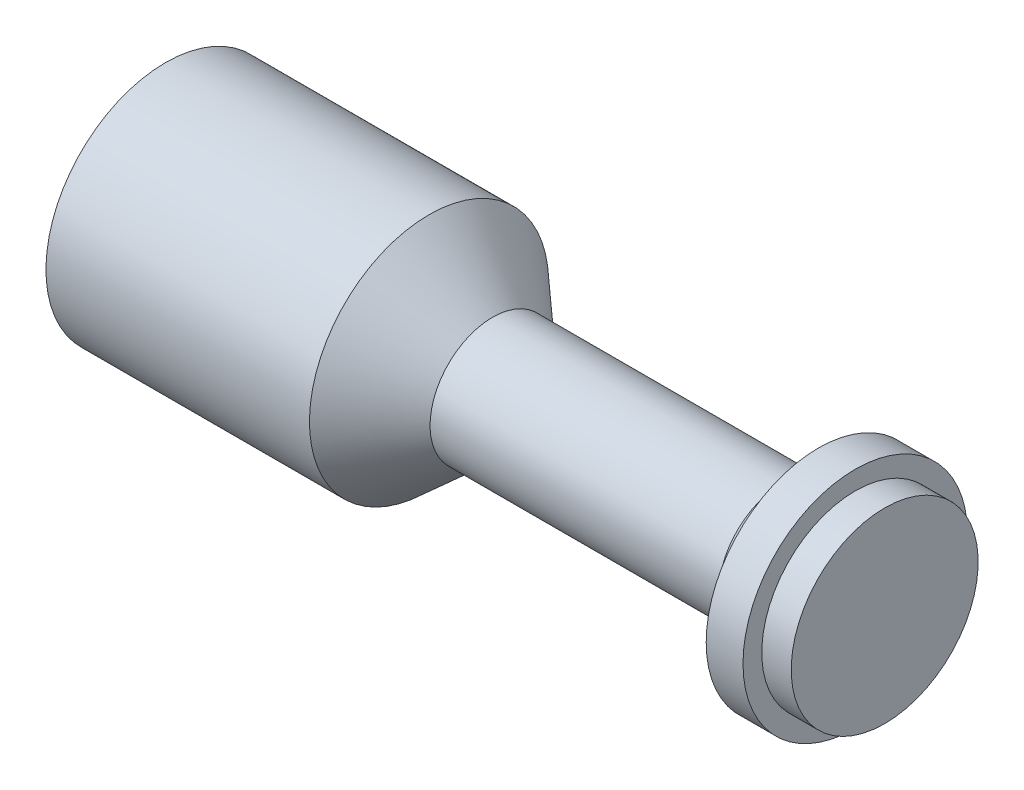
ISO-10303-21;
HEADER;
FILE_DESCRIPTION(('STEP AP214'),'2;1');
FILE_NAME('part.step','',(''),(''),'','','');
FILE_SCHEMA(('AUTOMOTIVE_DESIGN { 1 0 10303 214 1 1 1 1 }'));
ENDSEC;
DATA;
#1=APPLICATION_CONTEXT('core data for automotive mechanical design processes');
#2=APPLICATION_PROTOCOL_DEFINITION('international standard','automotive_design',2000,#1);
#3=PRODUCT_CONTEXT('',#1,'mechanical');
#4=PRODUCT('Part','Part','',(#3));
#5=PRODUCT_RELATED_PRODUCT_CATEGORY('part','',(#4));
#6=PRODUCT_DEFINITION_FORMATION('','',#4);
#7=PRODUCT_DEFINITION_CONTEXT('part definition',#1,'design');
#8=PRODUCT_DEFINITION('design','',#6,#7);
#9=PRODUCT_DEFINITION_SHAPE('','',#8);
#10=(LENGTH_UNIT() NAMED_UNIT(*) SI_UNIT(.MILLI.,.METRE.));
#11=(NAMED_UNIT(*) PLANE_ANGLE_UNIT() SI_UNIT($,.RADIAN.));
#12=(NAMED_UNIT(*) SI_UNIT($,.STERADIAN.) SOLID_ANGLE_UNIT());
#13=UNCERTAINTY_MEASURE_WITH_UNIT(LENGTH_MEASURE(1.E-05),#10,'distance_accuracy_value','');
#14=(GEOMETRIC_REPRESENTATION_CONTEXT(3) GLOBAL_UNCERTAINTY_ASSIGNED_CONTEXT((#13)) GLOBAL_UNIT_ASSIGNED_CONTEXT((#10,
#11,#12)) REPRESENTATION_CONTEXT('',''));
#15=CARTESIAN_POINT('',(0.,0.,0.));
#16=DIRECTION('',(0.,0.,1.));
#17=DIRECTION('',(1.,0.,0.));
#18=AXIS2_PLACEMENT_3D('',#15,#16,#17);
#19=CARTESIAN_POINT('',(-60.0156555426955,0.,0.));
#20=DIRECTION('',(-1.,0.,0.));
#21=DIRECTION('',(0.,-1.,0.));
#22=AXIS2_PLACEMENT_3D('',#19,#20,#21);
#23=PLANE('',#22);
#24=CARTESIAN_POINT('',(-60.0156555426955,0.,0.));
#25=DIRECTION('',(1.,0.,0.));
#26=DIRECTION('',(0.,1.,0.));
#27=AXIS2_PLACEMENT_3D('',#24,#25,#26);
#28=CIRCLE('',#27,16.25);
#29=CARTESIAN_POINT('',(-60.0156555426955,16.25,0.));
#30=VERTEX_POINT('',#29);
#31=EDGE_CURVE('E10',#30,#30,#28,.T.);
#32=ORIENTED_EDGE('',*,*,#31,.F.);
#33=EDGE_LOOP('',(#32));
#34=FACE_BOUND('',#33,.T.);
#35=ADVANCED_FACE('F30',(#34),#23,.T.);
#36=CARTESIAN_POINT('',(37.6843444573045,0.,0.));
#37=DIRECTION('',(1.,0.,0.));
#38=DIRECTION('',(0.,1.,0.));
#39=AXIS2_PLACEMENT_3D('',#36,#37,#38);
#40=CYLINDRICAL_SURFACE('',#39,16.25);
#41=ORIENTED_EDGE('',*,*,#31,.T.);
#42=EDGE_LOOP('',(#41));
#43=FACE_BOUND('',#42,.T.);
#44=CARTESIAN_POINT('',(-24.2156555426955,0.,0.));
#45=DIRECTION('',(1.,0.,0.));
#46=DIRECTION('',(0.,1.,0.));
#47=AXIS2_PLACEMENT_3D('',#44,#45,#46);
#48=CIRCLE('',#47,16.25);
#49=CARTESIAN_POINT('',(-24.2156555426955,16.25,0.));
#50=VERTEX_POINT('',#49);
#51=EDGE_CURVE('E36',#50,#50,#48,.T.);
#52=ORIENTED_EDGE('',*,*,#51,.F.);
#53=EDGE_LOOP('',(#52));
#54=FACE_BOUND('',#53,.T.);
#55=ADVANCED_FACE('F84',(#43,#54),#40,.T.);
#56=CARTESIAN_POINT('',(-15.5828430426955,0.,0.));
#57=DIRECTION('',(-1.,0.,0.));
#58=DIRECTION('',(0.,-1.,0.));
#59=AXIS2_PLACEMENT_3D('',#56,#57,#58);
#60=CONICAL_SURFACE('',#59,8.5,0.731563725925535);
#61=ORIENTED_EDGE('',*,*,#51,.T.);
#62=EDGE_LOOP('',(#61));
#63=FACE_BOUND('',#62,.T.);
#64=CARTESIAN_POINT('',(-15.5828430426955,0.,0.));
#65=DIRECTION('',(1.,0.,0.));
#66=DIRECTION('',(0.,1.,0.));
#67=AXIS2_PLACEMENT_3D('',#64,#65,#66);
#68=CIRCLE('',#67,8.5);
#69=CARTESIAN_POINT('',(-15.5828430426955,8.50000000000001,0.));
#70=VERTEX_POINT('',#69);
#71=EDGE_CURVE('E40',#70,#70,#68,.T.);
#72=ORIENTED_EDGE('',*,*,#71,.F.);
#73=EDGE_LOOP('',(#72));
#74=FACE_BOUND('',#73,.T.);
#75=ADVANCED_FACE('F89',(#63,#74),#60,.T.);
#76=CARTESIAN_POINT('',(37.6843444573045,0.,0.));
#77=DIRECTION('',(1.,0.,0.));
#78=DIRECTION('',(0.,1.,0.));
#79=AXIS2_PLACEMENT_3D('',#76,#77,#78);
#80=CYLINDRICAL_SURFACE('',#79,8.5);
#81=ORIENTED_EDGE('',*,*,#71,.T.);
#82=EDGE_LOOP('',(#81));
#83=FACE_BOUND('',#82,.T.);
#84=CARTESIAN_POINT('',(23.6491428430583,0.,0.));
#85=DIRECTION('',(1.,0.,0.));
#86=DIRECTION('',(0.,1.,0.));
#87=AXIS2_PLACEMENT_3D('',#84,#85,#86);
#88=CIRCLE('',#87,8.49999999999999);
#89=CARTESIAN_POINT('',(23.6491428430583,8.50000000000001,0.));
#90=VERTEX_POINT('',#89);
#91=EDGE_CURVE('E44',#90,#90,#88,.T.);
#92=ORIENTED_EDGE('',*,*,#91,.F.);
#93=EDGE_LOOP('',(#92));
#94=FACE_BOUND('',#93,.T.);
#95=ADVANCED_FACE('F93',(#83,#94),#80,.T.);
#96=CARTESIAN_POINT('',(26.0596852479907,0.,0.));
#97=DIRECTION('',(1.,0.,0.));
#98=DIRECTION('',(0.,1.,0.));
#99=AXIS2_PLACEMENT_3D('',#96,#97,#98);
#100=CONICAL_SURFACE('',#99,10.9105424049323,0.785398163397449);
#101=ORIENTED_EDGE('',*,*,#91,.T.);
#102=EDGE_LOOP('',(#101));
#103=FACE_BOUND('',#102,.T.);
#104=CARTESIAN_POINT('',(26.0596852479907,0.,0.));
#105=DIRECTION('',(1.,0.,0.));
#106=DIRECTION('',(0.,1.,0.));
#107=AXIS2_PLACEMENT_3D('',#104,#105,#106);
#108=CIRCLE('',#107,10.9105424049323);
#109=CARTESIAN_POINT('',(26.0596852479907,10.9105424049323,0.));
#110=VERTEX_POINT('',#109);
#111=EDGE_CURVE('E49',#110,#110,#108,.T.);
#112=ORIENTED_EDGE('',*,*,#111,.F.);
#113=EDGE_LOOP('',(#112));
#114=FACE_BOUND('',#113,.T.);
#115=ADVANCED_FACE('F99',(#103,#114),#100,.T.);
#116=CARTESIAN_POINT('',(37.6843444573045,0.,0.));
#117=DIRECTION('',(1.,0.,0.));
#118=DIRECTION('',(0.,1.,0.));
#119=AXIS2_PLACEMENT_3D('',#116,#117,#118);
#120=CYLINDRICAL_SURFACE('',#119,10.9105424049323);
#121=ORIENTED_EDGE('',*,*,#111,.T.);
#122=EDGE_LOOP('',(#121));
#123=FACE_BOUND('',#122,.T.);
#124=CARTESIAN_POINT('',(28.6843444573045,0.,0.));
#125=DIRECTION('',(1.,0.,0.));
#126=DIRECTION('',(0.,1.,0.));
#127=AXIS2_PLACEMENT_3D('',#124,#125,#126);
#128=CIRCLE('',#127,10.9105424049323);
#129=CARTESIAN_POINT('',(28.6843444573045,10.9105424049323,0.));
#130=VERTEX_POINT('',#129);
#131=EDGE_CURVE('E52',#130,#130,#128,.T.);
#132=ORIENTED_EDGE('',*,*,#131,.F.);
#133=EDGE_LOOP('',(#132));
#134=FACE_BOUND('',#133,.T.);
#135=ADVANCED_FACE('F103',(#123,#134),#120,.T.);
#136=CARTESIAN_POINT('',(28.6843444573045,10.9105424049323,0.));
#137=DIRECTION('',(-1.,0.,0.));
#138=DIRECTION('',(0.,-1.,0.));
#139=AXIS2_PLACEMENT_3D('',#136,#137,#138);
#140=PLANE('',#139);
#141=ORIENTED_EDGE('',*,*,#131,.T.);
#142=EDGE_LOOP('',(#141));
#143=FACE_BOUND('',#142,.T.);
#144=CARTESIAN_POINT('',(28.6843444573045,0.,0.));
#145=DIRECTION('',(1.,0.,0.));
#146=DIRECTION('',(0.,1.,0.));
#147=AXIS2_PLACEMENT_3D('',#144,#145,#146);
#148=CIRCLE('',#147,15.25);
#149=CARTESIAN_POINT('',(28.6843444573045,15.25,0.));
#150=VERTEX_POINT('',#149);
#151=EDGE_CURVE('E55',#150,#150,#148,.T.);
#152=ORIENTED_EDGE('',*,*,#151,.F.);
#153=EDGE_LOOP('',(#152));
#154=FACE_BOUND('',#153,.T.);
#155=ADVANCED_FACE('F107',(#143,#154),#140,.T.);
#156=CARTESIAN_POINT('',(37.6843444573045,0.,0.));
#157=DIRECTION('',(1.,0.,0.));
#158=DIRECTION('',(0.,1.,0.));
#159=AXIS2_PLACEMENT_3D('',#156,#157,#158);
#160=CYLINDRICAL_SURFACE('',#159,15.25);
#161=ORIENTED_EDGE('',*,*,#151,.T.);
#162=EDGE_LOOP('',(#161));
#163=FACE_BOUND('',#162,.T.);
#164=CARTESIAN_POINT('',(33.6843444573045,0.,0.));
#165=DIRECTION('',(1.,0.,0.));
#166=DIRECTION('',(0.,1.,0.));
#167=AXIS2_PLACEMENT_3D('',#164,#165,#166);
#168=CIRCLE('',#167,15.25);
#169=CARTESIAN_POINT('',(33.6843444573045,15.25,0.));
#170=VERTEX_POINT('',#169);
#171=EDGE_CURVE('E58',#170,#170,#168,.T.);
#172=ORIENTED_EDGE('',*,*,#171,.F.);
#173=EDGE_LOOP('',(#172));
#174=FACE_BOUND('',#173,.T.);
#175=ADVANCED_FACE('F80',(#163,#174),#160,.T.);
#176=CARTESIAN_POINT('',(33.6843444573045,15.25,0.));
#177=DIRECTION('',(1.,0.,0.));
#178=DIRECTION('',(0.,1.,0.));
#179=AXIS2_PLACEMENT_3D('',#176,#177,#178);
#180=PLANE('',#179);
#181=ORIENTED_EDGE('',*,*,#171,.T.);
#182=EDGE_LOOP('',(#181));
#183=FACE_BOUND('',#182,.T.);
#184=CARTESIAN_POINT('',(33.6843444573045,0.,0.));
#185=DIRECTION('',(1.,0.,0.));
#186=DIRECTION('',(0.,1.,0.));
#187=AXIS2_PLACEMENT_3D('',#184,#185,#186);
#188=CIRCLE('',#187,12.7);
#189=CARTESIAN_POINT('',(33.6843444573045,12.7,0.));
#190=VERTEX_POINT('',#189);
#191=EDGE_CURVE('E61',#190,#190,#188,.T.);
#192=ORIENTED_EDGE('',*,*,#191,.F.);
#193=EDGE_LOOP('',(#192));
#194=FACE_BOUND('',#193,.T.);
#195=ADVANCED_FACE('F72',(#183,#194),#180,.T.);
#196=CARTESIAN_POINT('',(37.6843444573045,0.,0.));
#197=DIRECTION('',(1.,0.,0.));
#198=DIRECTION('',(0.,1.,0.));
#199=AXIS2_PLACEMENT_3D('',#196,#197,#198);
#200=CYLINDRICAL_SURFACE('',#199,12.7);
#201=ORIENTED_EDGE('',*,*,#191,.T.);
#202=EDGE_LOOP('',(#201));
#203=FACE_BOUND('',#202,.T.);
#204=CARTESIAN_POINT('',(37.6843444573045,0.,0.));
#205=DIRECTION('',(1.,0.,0.));
#206=DIRECTION('',(0.,1.,0.));
#207=AXIS2_PLACEMENT_3D('',#204,#205,#206);
#208=CIRCLE('',#207,12.7);
#209=CARTESIAN_POINT('',(37.6843444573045,12.7,0.));
#210=VERTEX_POINT('',#209);
#211=EDGE_CURVE('E64',#210,#210,#208,.T.);
#212=ORIENTED_EDGE('',*,*,#211,.F.);
#213=EDGE_LOOP('',(#212));
#214=FACE_BOUND('',#213,.T.);
#215=ADVANCED_FACE('F70',(#203,#214),#200,.T.);
#216=CARTESIAN_POINT('',(37.6843444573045,12.7,0.));
#217=DIRECTION('',(1.,0.,0.));
#218=DIRECTION('',(0.,1.,0.));
#219=AXIS2_PLACEMENT_3D('',#216,#217,#218);
#220=PLANE('',#219);
#221=ORIENTED_EDGE('',*,*,#211,.T.);
#222=EDGE_LOOP('',(#221));
#223=FACE_BOUND('',#222,.T.);
#224=ADVANCED_FACE('F68',(#223),#220,.T.);
#225=CLOSED_SHELL('',(#35,#55,#75,#95,#115,#135,#155,#175,#195,#215,#224));
#226=MANIFOLD_SOLID_BREP('B2',#225);
#227=ADVANCED_BREP_SHAPE_REPRESENTATION('',(#18,#226),#14);
#228=SHAPE_DEFINITION_REPRESENTATION(#9,#227);
ENDSEC;
END-ISO-10303-21;
